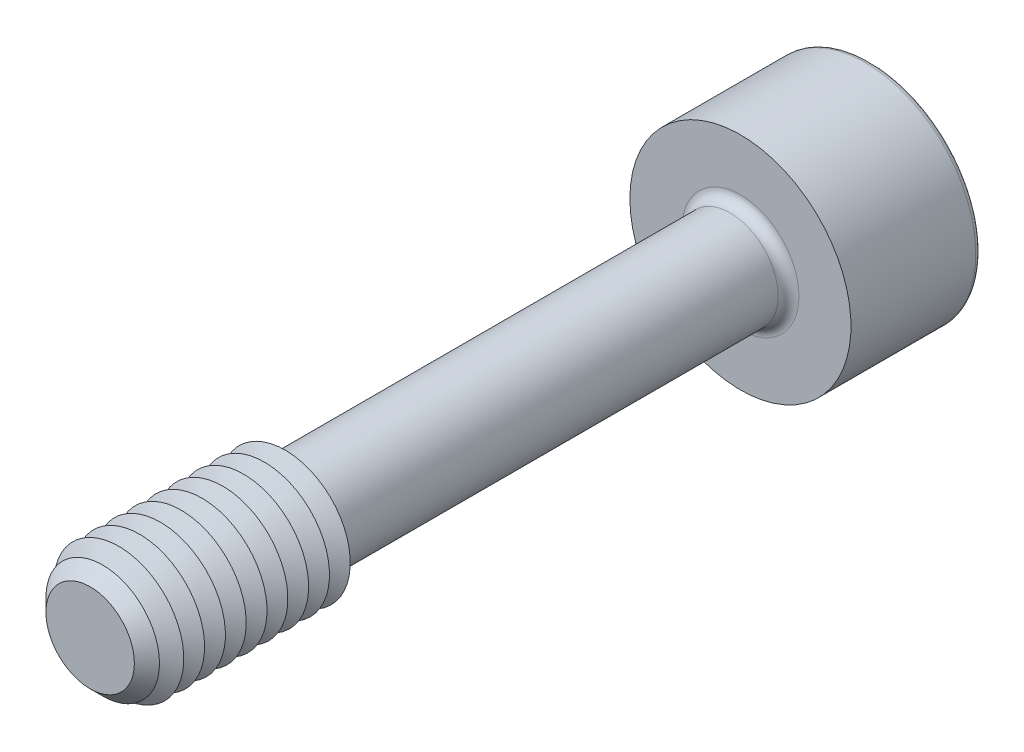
from build123d import *

# Parameters (mm, degrees)
SKETCH1_R       = 1.85
EXTRUDE1_DEPTH  = 12.5
CHAMFER1_SIZE   = 0.8
SKETCH3_R       = 4.25
EXTRUDE2_DEPTH  = 5
EXTRUDE3_DEPTH  = 4
FILLET1_R       = 0.4
FILLET2_R       = 0.2
LPATTERN1_COUNT = 9
LPATTERN1_PITCH = 0.8


with BuildPart() as part:
    # Sketch1 → Extrude1 (new, symmetric)
    with BuildSketch(Plane.XY):
        Circle(SKETCH1_R)
    extrude(amount=EXTRUDE1_DEPTH, both=True)

    # Sketch2 → Revolve1 (revolve)
    with BuildSketch(Plane(origin=(0, 0, 0), x_dir=(0, 0, -1), z_dir=(1, 0, 0))):
        Polygon((-12.5, 0), (-12.5, 2.5), (-5, 2.5), (-4.624722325, 1.85), (-4.624722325, 0), align=None)
    revolve(axis=Axis((0, 0, 4.624722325), (0, 0, 1)))

    # Chamfer1
    chamfer1_edges = [part.edges().sort_by_distance(p)[0] for p in [
        (0, -2.5, 12.5),
    ]]
    chamfer(chamfer1_edges, length=CHAMFER1_SIZE)

    # Sketch3 → Extrude2 (add)
    with BuildSketch(Plane(origin=(0, 0, -12.5), x_dir=(-1, 0, 0), z_dir=(0, 0, -1))):
        Circle(SKETCH3_R)
    extrude(amount=EXTRUDE2_DEPTH)

    # Sketch4 → Extrude3 (cut)
    with BuildSketch(Plane(origin=(-13.7, 0, -17.5), x_dir=(1, 0, 0), z_dir=(0, 0, 1))):
        Polygon((12.545299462, -2), (14.854700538, -2), (16.009401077, 0), (14.854700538, 2), (12.545299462, 2), (11.390598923, 0), align=None)
    extrude(amount=EXTRUDE3_DEPTH, mode=Mode.SUBTRACT)

    # Fillet1
    fillet1_edges = [part.edges().sort_by_distance(p)[0] for p in [
        (-1.85, 0, -12.5),
    ]]
    fillet(fillet1_edges, radius=FILLET1_R)

    # Fillet2
    fillet2_edges = [part.edges().sort_by_distance(p)[0] for p in [
        (4.25, 0, -17.5),
    ]]
    fillet(fillet2_edges, radius=FILLET2_R)

    # Sketch5 → Cut-Revolve1 (revolve, cut)
    with BuildSketch(Plane(origin=(0, 0, 0), x_dir=(0, 0, -1), z_dir=(1, 0, 0)), mode=Mode.PRIVATE) as cut_revolve1_sk:
        Polygon((13.5, 0), (13.5, -2), (12.345299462, 0), align=None)
    revolve(cut_revolve1_sk.sketch.rotate(Axis((0, 0, -12.345299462), (0, 0, -1)), 90), axis=Axis((0, 0, -12.345299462), (0, 0, -1)), mode=Mode.SUBTRACT)

    # Sketch7 → Cut-Revolve2 (revolve, cut)
    with BuildSketch(Plane(origin=(0, 0, 0), x_dir=(0, 0, -1), z_dir=(1, 0, 0)), mode=Mode.PRIVATE) as cut_revolve2_sk:
        Polygon((-5, 2.5), (-5.4, 1.807179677), (-5.8, 2.5), align=None)
    cut_revolve2 = revolve(cut_revolve2_sk.sketch.rotate(Axis((0, 0, -1.332048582), (0, 0, 1)), 90), axis=Axis((0, 0, -1.332048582), (0, 0, 1)), mode=Mode.SUBTRACT)

    # LPattern1: Cut-Revolve2 ×9
    with Locations(*[(0, 0, i * LPATTERN1_PITCH) for i in range(1, LPATTERN1_COUNT)]):
        add(cut_revolve2, mode=Mode.SUBTRACT)


solid = part.part
